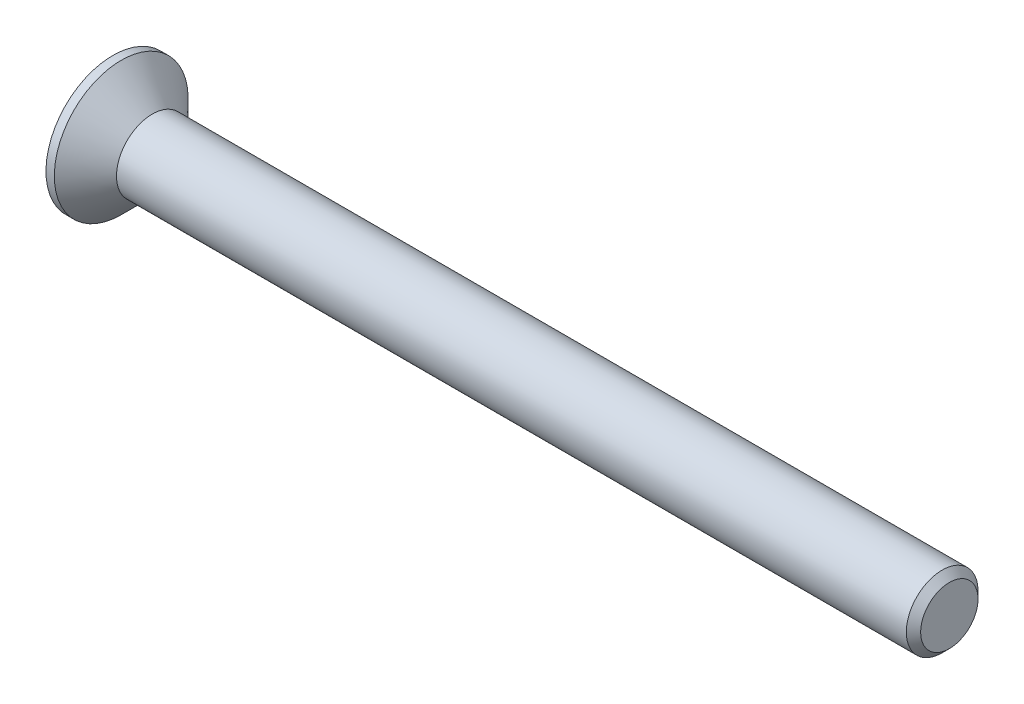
from build123d import *

# Parameters (mm, degrees)
CHAMFER1_SIZE      = 0.3
CUT_EXTRUDE1_DEPTH = 1.25


with BuildPart() as part:
    # Sketch1 → Revolve1 (revolve)
    with BuildSketch(Plane.XY, mode=Mode.PRIVATE) as revolve1_sk:
        Polygon((-1.65, 2.8), (-1.65, 0), (33.35, 0), (33.35, 1.5), (0, 1.5), (-1.3, 2.8), align=None)
    revolve(revolve1_sk.sketch.rotate(Axis((-1.65, 0, 0), (1, 0, 0)), 180), axis=Axis((-1.65, 0, 0), (1, 0, 0)))

    # Chamfer1
    chamfer1_edges = [part.edges().sort_by_distance(p)[0] for p in [
        (33.35, 1.5, 0),
    ]]
    chamfer(chamfer1_edges, length=CHAMFER1_SIZE)

    # Sketch2 → Cut-Extrude1 (cut)
    with BuildSketch(Plane.ZY.offset(1.65)):
        Polygon((-0.365, 1.45), (0.365, 1.45), (0.365, 0.365), (1.45, 0.365), (1.45, -0.365), (0.365, -0.365), (0.365, -1.45), (-0.365, -1.45), (-0.365, -0.365), (-1.45, -0.365), (-1.45, 0.365), (-0.365, 0.365), align=None)
    extrude(amount=-CUT_EXTRUDE1_DEPTH, mode=Mode.SUBTRACT)


solid = part.part
